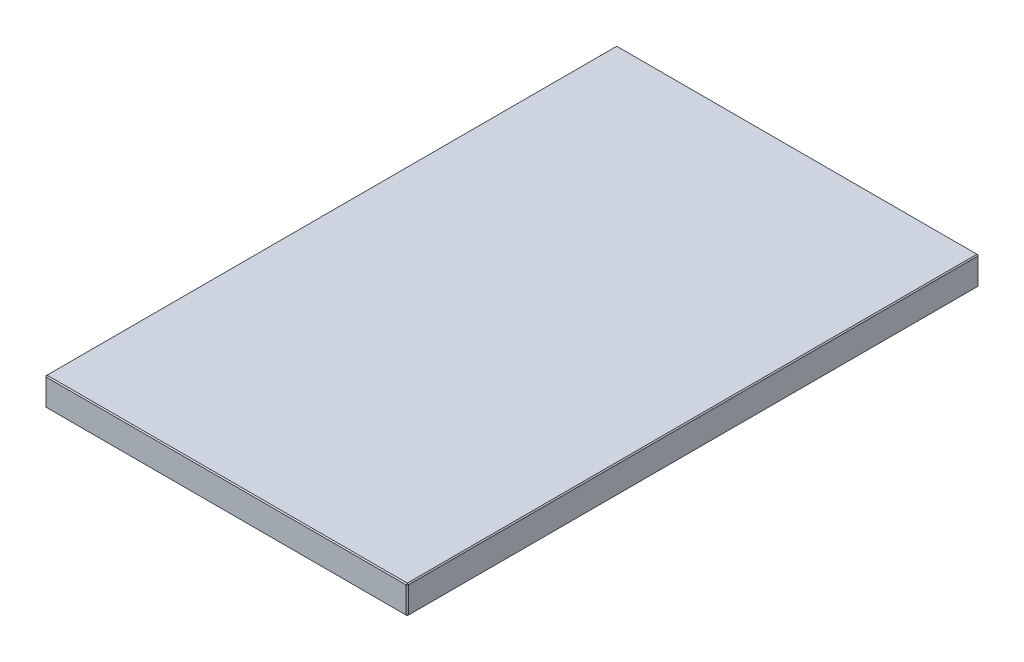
ISO-10303-21;
HEADER;
FILE_DESCRIPTION(('STEP AP214'),'2;1');
FILE_NAME('part.step','',(''),(''),'','','');
FILE_SCHEMA(('AUTOMOTIVE_DESIGN { 1 0 10303 214 1 1 1 1 }'));
ENDSEC;
DATA;
#1=APPLICATION_CONTEXT('core data for automotive mechanical design processes');
#2=APPLICATION_PROTOCOL_DEFINITION('international standard','automotive_design',2000,#1);
#3=PRODUCT_CONTEXT('',#1,'mechanical');
#4=PRODUCT('Part','Part','',(#3));
#5=PRODUCT_RELATED_PRODUCT_CATEGORY('part','',(#4));
#6=PRODUCT_DEFINITION_FORMATION('','',#4);
#7=PRODUCT_DEFINITION_CONTEXT('part definition',#1,'design');
#8=PRODUCT_DEFINITION('design','',#6,#7);
#9=PRODUCT_DEFINITION_SHAPE('','',#8);
#10=(LENGTH_UNIT() NAMED_UNIT(*) SI_UNIT(.MILLI.,.METRE.));
#11=(NAMED_UNIT(*) PLANE_ANGLE_UNIT() SI_UNIT($,.RADIAN.));
#12=(NAMED_UNIT(*) SI_UNIT($,.STERADIAN.) SOLID_ANGLE_UNIT());
#13=UNCERTAINTY_MEASURE_WITH_UNIT(LENGTH_MEASURE(1.E-05),#10,'distance_accuracy_value','');
#14=(GEOMETRIC_REPRESENTATION_CONTEXT(3) GLOBAL_UNCERTAINTY_ASSIGNED_CONTEXT((#13)) GLOBAL_UNIT_ASSIGNED_CONTEXT((#10,
#11,#12)) REPRESENTATION_CONTEXT('',''));
#15=CARTESIAN_POINT('',(0.,0.,0.));
#16=DIRECTION('',(0.,0.,1.));
#17=DIRECTION('',(1.,0.,0.));
#18=AXIS2_PLACEMENT_3D('',#15,#16,#17);
#19=CARTESIAN_POINT('',(-173.,27.,273.));
#20=DIRECTION('',(1.,0.,0.));
#21=DIRECTION('',(0.,0.,-1.));
#22=AXIS2_PLACEMENT_3D('',#19,#20,#21);
#23=PLANE('',#22);
#24=DIRECTION('',(0.,-1.,0.));
#25=VECTOR('',#24,1.);
#26=CARTESIAN_POINT('',(-173.,27.,-272.));
#27=LINE('',#26,#25);
#28=CARTESIAN_POINT('',(-173.,26.,-272.));
#29=VERTEX_POINT('',#28);
#30=CARTESIAN_POINT('',(-173.,0.999999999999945,-272.));
#31=VERTEX_POINT('',#30);
#32=EDGE_CURVE('E114',#29,#31,#27,.T.);
#33=ORIENTED_EDGE('',*,*,#32,.T.);
#34=DIRECTION('',(0.,0.,1.));
#35=VECTOR('',#34,1.);
#36=CARTESIAN_POINT('',(-173.,0.999999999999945,273.));
#37=LINE('',#36,#35);
#38=CARTESIAN_POINT('',(-173.,0.999999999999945,272.));
#39=VERTEX_POINT('',#38);
#40=EDGE_CURVE('E110',#31,#39,#37,.T.);
#41=ORIENTED_EDGE('',*,*,#40,.T.);
#42=DIRECTION('',(0.,1.,0.));
#43=VECTOR('',#42,1.);
#44=CARTESIAN_POINT('',(-173.,27.,272.));
#45=LINE('',#44,#43);
#46=CARTESIAN_POINT('',(-173.,26.,272.));
#47=VERTEX_POINT('',#46);
#48=EDGE_CURVE('E103',#39,#47,#45,.T.);
#49=ORIENTED_EDGE('',*,*,#48,.T.);
#50=DIRECTION('',(0.,0.,-1.));
#51=VECTOR('',#50,1.);
#52=CARTESIAN_POINT('',(-173.,26.,-273.));
#53=LINE('',#52,#51);
#54=EDGE_CURVE('E107',#47,#29,#53,.T.);
#55=ORIENTED_EDGE('',*,*,#54,.T.);
#56=EDGE_LOOP('',(#33,#41,#49,#55));
#57=FACE_BOUND('',#56,.T.);
#58=ADVANCED_FACE('F15',(#57),#23,.F.);
#59=CARTESIAN_POINT('',(173.,27.,273.));
#60=DIRECTION('',(0.,0.,-1.));
#61=DIRECTION('',(-1.,0.,0.));
#62=AXIS2_PLACEMENT_3D('',#59,#60,#61);
#63=PLANE('',#62);
#64=DIRECTION('',(-1.,0.,0.));
#65=VECTOR('',#64,1.);
#66=CARTESIAN_POINT('',(-173.,26.,273.));
#67=LINE('',#66,#65);
#68=CARTESIAN_POINT('',(172.,26.,273.));
#69=VERTEX_POINT('',#68);
#70=CARTESIAN_POINT('',(-172.,26.,273.));
#71=VERTEX_POINT('',#70);
#72=EDGE_CURVE('E164',#69,#71,#67,.T.);
#73=ORIENTED_EDGE('',*,*,#72,.T.);
#74=DIRECTION('',(0.,-1.,0.));
#75=VECTOR('',#74,1.);
#76=CARTESIAN_POINT('',(-172.,27.,273.));
#77=LINE('',#76,#75);
#78=CARTESIAN_POINT('',(-172.,0.999999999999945,273.));
#79=VERTEX_POINT('',#78);
#80=EDGE_CURVE('E122',#71,#79,#77,.T.);
#81=ORIENTED_EDGE('',*,*,#80,.T.);
#82=DIRECTION('',(1.,0.,0.));
#83=VECTOR('',#82,1.);
#84=CARTESIAN_POINT('',(173.,0.999999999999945,273.));
#85=LINE('',#84,#83);
#86=CARTESIAN_POINT('',(172.,0.999999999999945,273.));
#87=VERTEX_POINT('',#86);
#88=EDGE_CURVE('E168',#79,#87,#85,.T.);
#89=ORIENTED_EDGE('',*,*,#88,.T.);
#90=DIRECTION('',(0.,1.,0.));
#91=VECTOR('',#90,1.);
#92=CARTESIAN_POINT('',(172.,27.,273.));
#93=LINE('',#92,#91);
#94=EDGE_CURVE('E166',#87,#69,#93,.T.);
#95=ORIENTED_EDGE('',*,*,#94,.T.);
#96=EDGE_LOOP('',(#73,#81,#89,#95));
#97=FACE_BOUND('',#96,.T.);
#98=ADVANCED_FACE('F275',(#97),#63,.F.);
#99=CARTESIAN_POINT('',(173.,27.,273.));
#100=DIRECTION('',(-1.,0.,0.));
#101=DIRECTION('',(0.,0.,1.));
#102=AXIS2_PLACEMENT_3D('',#99,#100,#101);
#103=PLANE('',#102);
#104=DIRECTION('',(0.,0.,-1.));
#105=VECTOR('',#104,1.);
#106=CARTESIAN_POINT('',(173.,0.999999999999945,273.));
#107=LINE('',#106,#105);
#108=CARTESIAN_POINT('',(173.,0.999999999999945,272.));
#109=VERTEX_POINT('',#108);
#110=CARTESIAN_POINT('',(173.,0.999999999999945,-272.));
#111=VERTEX_POINT('',#110);
#112=EDGE_CURVE('E159',#109,#111,#107,.T.);
#113=ORIENTED_EDGE('',*,*,#112,.T.);
#114=DIRECTION('',(0.,1.,0.));
#115=VECTOR('',#114,1.);
#116=CARTESIAN_POINT('',(173.,27.,-272.));
#117=LINE('',#116,#115);
#118=CARTESIAN_POINT('',(173.,26.,-272.));
#119=VERTEX_POINT('',#118);
#120=EDGE_CURVE('E161',#111,#119,#117,.T.);
#121=ORIENTED_EDGE('',*,*,#120,.T.);
#122=DIRECTION('',(0.,0.,1.));
#123=VECTOR('',#122,1.);
#124=CARTESIAN_POINT('',(173.,26.,273.));
#125=LINE('',#124,#123);
#126=CARTESIAN_POINT('',(173.,26.,272.));
#127=VERTEX_POINT('',#126);
#128=EDGE_CURVE('E155',#119,#127,#125,.T.);
#129=ORIENTED_EDGE('',*,*,#128,.T.);
#130=DIRECTION('',(0.,-1.,0.));
#131=VECTOR('',#130,1.);
#132=CARTESIAN_POINT('',(173.,27.,272.));
#133=LINE('',#132,#131);
#134=EDGE_CURVE('E157',#127,#109,#133,.T.);
#135=ORIENTED_EDGE('',*,*,#134,.T.);
#136=EDGE_LOOP('',(#113,#121,#129,#135));
#137=FACE_BOUND('',#136,.T.);
#138=ADVANCED_FACE('F254',(#137),#103,.F.);
#139=CARTESIAN_POINT('',(173.,27.,-273.));
#140=DIRECTION('',(0.,0.,1.));
#141=DIRECTION('',(1.,0.,0.));
#142=AXIS2_PLACEMENT_3D('',#139,#140,#141);
#143=PLANE('',#142);
#144=DIRECTION('',(0.,-1.,0.));
#145=VECTOR('',#144,1.);
#146=CARTESIAN_POINT('',(172.,27.,-273.));
#147=LINE('',#146,#145);
#148=CARTESIAN_POINT('',(172.,26.,-273.));
#149=VERTEX_POINT('',#148);
#150=CARTESIAN_POINT('',(172.,0.999999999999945,-273.));
#151=VERTEX_POINT('',#150);
#152=EDGE_CURVE('E148',#149,#151,#147,.T.);
#153=ORIENTED_EDGE('',*,*,#152,.T.);
#154=DIRECTION('',(-1.,0.,0.));
#155=VECTOR('',#154,1.);
#156=CARTESIAN_POINT('',(173.,0.999999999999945,-273.));
#157=LINE('',#156,#155);
#158=CARTESIAN_POINT('',(-172.,0.999999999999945,-273.));
#159=VERTEX_POINT('',#158);
#160=EDGE_CURVE('E153',#151,#159,#157,.T.);
#161=ORIENTED_EDGE('',*,*,#160,.T.);
#162=DIRECTION('',(0.,1.,0.));
#163=VECTOR('',#162,1.);
#164=CARTESIAN_POINT('',(-172.,27.,-273.));
#165=LINE('',#164,#163);
#166=CARTESIAN_POINT('',(-172.,26.,-273.));
#167=VERTEX_POINT('',#166);
#168=EDGE_CURVE('E150',#159,#167,#165,.T.);
#169=ORIENTED_EDGE('',*,*,#168,.T.);
#170=DIRECTION('',(1.,0.,0.));
#171=VECTOR('',#170,1.);
#172=CARTESIAN_POINT('',(173.,26.,-273.));
#173=LINE('',#172,#171);
#174=EDGE_CURVE('E146',#167,#149,#173,.T.);
#175=ORIENTED_EDGE('',*,*,#174,.T.);
#176=EDGE_LOOP('',(#153,#161,#169,#175));
#177=FACE_BOUND('',#176,.T.);
#178=ADVANCED_FACE('F284',(#177),#143,.F.);
#179=CARTESIAN_POINT('',(0.,27.,0.));
#180=DIRECTION('',(0.,1.,0.));
#181=DIRECTION('',(0.,0.,1.));
#182=AXIS2_PLACEMENT_3D('',#179,#180,#181);
#183=PLANE('',#182);
#184=DIRECTION('',(0.,0.,-1.));
#185=VECTOR('',#184,1.);
#186=CARTESIAN_POINT('',(172.,27.,-273.));
#187=LINE('',#186,#185);
#188=CARTESIAN_POINT('',(172.,27.,272.));
#189=VERTEX_POINT('',#188);
#190=CARTESIAN_POINT('',(172.,27.,-272.));
#191=VERTEX_POINT('',#190);
#192=EDGE_CURVE('E24',#189,#191,#187,.T.);
#193=ORIENTED_EDGE('',*,*,#192,.T.);
#194=DIRECTION('',(-1.,0.,0.));
#195=VECTOR('',#194,1.);
#196=CARTESIAN_POINT('',(-173.,27.,-272.));
#197=LINE('',#196,#195);
#198=CARTESIAN_POINT('',(-172.,27.,-272.));
#199=VERTEX_POINT('',#198);
#200=EDGE_CURVE('E9',#191,#199,#197,.T.);
#201=ORIENTED_EDGE('',*,*,#200,.T.);
#202=DIRECTION('',(0.,0.,1.));
#203=VECTOR('',#202,1.);
#204=CARTESIAN_POINT('',(-172.,27.,273.));
#205=LINE('',#204,#203);
#206=CARTESIAN_POINT('',(-172.,27.,272.));
#207=VERTEX_POINT('',#206);
#208=EDGE_CURVE('E180',#199,#207,#205,.T.);
#209=ORIENTED_EDGE('',*,*,#208,.T.);
#210=DIRECTION('',(1.,0.,0.));
#211=VECTOR('',#210,1.);
#212=CARTESIAN_POINT('',(173.,27.,272.));
#213=LINE('',#212,#211);
#214=EDGE_CURVE('E35',#207,#189,#213,.T.);
#215=ORIENTED_EDGE('',*,*,#214,.T.);
#216=EDGE_LOOP('',(#193,#201,#209,#215));
#217=FACE_BOUND('',#216,.T.);
#218=ADVANCED_FACE('F350',(#217),#183,.T.);
#219=CARTESIAN_POINT('',(0.,0.,0.));
#220=DIRECTION('',(0.,1.,0.));
#221=DIRECTION('',(0.,0.,1.));
#222=AXIS2_PLACEMENT_3D('',#219,#220,#221);
#223=PLANE('',#222);
#224=DIRECTION('',(0.,0.,1.));
#225=VECTOR('',#224,1.);
#226=CARTESIAN_POINT('',(172.,0.,0.));
#227=LINE('',#226,#225);
#228=CARTESIAN_POINT('',(172.,0.,-272.));
#229=VERTEX_POINT('',#228);
#230=CARTESIAN_POINT('',(172.,0.,272.));
#231=VERTEX_POINT('',#230);
#232=EDGE_CURVE('E171',#229,#231,#227,.T.);
#233=ORIENTED_EDGE('',*,*,#232,.T.);
#234=DIRECTION('',(-1.,0.,0.));
#235=VECTOR('',#234,1.);
#236=CARTESIAN_POINT('',(0.,0.,272.));
#237=LINE('',#236,#235);
#238=CARTESIAN_POINT('',(-172.,0.,272.));
#239=VERTEX_POINT('',#238);
#240=EDGE_CURVE('E177',#231,#239,#237,.T.);
#241=ORIENTED_EDGE('',*,*,#240,.T.);
#242=DIRECTION('',(0.,0.,-1.));
#243=VECTOR('',#242,1.);
#244=CARTESIAN_POINT('',(-172.,0.,0.));
#245=LINE('',#244,#243);
#246=CARTESIAN_POINT('',(-172.,0.,-272.));
#247=VERTEX_POINT('',#246);
#248=EDGE_CURVE('E175',#239,#247,#245,.T.);
#249=ORIENTED_EDGE('',*,*,#248,.T.);
#250=DIRECTION('',(1.,0.,0.));
#251=VECTOR('',#250,1.);
#252=CARTESIAN_POINT('',(0.,0.,-272.));
#253=LINE('',#252,#251);
#254=EDGE_CURVE('E173',#247,#229,#253,.T.);
#255=ORIENTED_EDGE('',*,*,#254,.T.);
#256=EDGE_LOOP('',(#233,#241,#249,#255));
#257=FACE_BOUND('',#256,.T.);
#258=ADVANCED_FACE('F246',(#257),#223,.F.);
#259=CARTESIAN_POINT('',(173.,27.,272.));
#260=DIRECTION('',(-0.707106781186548,0.,-0.707106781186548));
#261=DIRECTION('',(0.,-1.,0.));
#262=AXIS2_PLACEMENT_3D('',#259,#260,#261);
#263=PLANE('',#262);
#264=DIRECTION('',(-0.707106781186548,0.,0.707106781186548));
#265=VECTOR('',#264,1.);
#266=CARTESIAN_POINT('',(172.,26.,273.));
#267=LINE('',#266,#265);
#268=EDGE_CURVE('E19',#69,#127,#267,.F.);
#269=ORIENTED_EDGE('',*,*,#268,.F.);
#270=ORIENTED_EDGE('',*,*,#94,.F.);
#271=DIRECTION('',(0.707106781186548,0.,-0.707106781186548));
#272=VECTOR('',#271,1.);
#273=CARTESIAN_POINT('',(172.,0.999999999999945,273.));
#274=LINE('',#273,#272);
#275=EDGE_CURVE('E142',#109,#87,#274,.F.);
#276=ORIENTED_EDGE('',*,*,#275,.F.);
#277=ORIENTED_EDGE('',*,*,#134,.F.);
#278=EDGE_LOOP('',(#269,#270,#276,#277));
#279=FACE_BOUND('',#278,.T.);
#280=ADVANCED_FACE('F17',(#279),#263,.F.);
#281=CARTESIAN_POINT('',(172.,26.,273.));
#282=DIRECTION('',(0.577350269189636,0.577350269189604,0.577350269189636));
#283=DIRECTION('',(0.707106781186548,0.,-0.707106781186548));
#284=AXIS2_PLACEMENT_3D('',#281,#282,#283);
#285=PLANE('',#284);
#286=DIRECTION('',(0.,-0.707106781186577,0.707106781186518));
#287=VECTOR('',#286,1.);
#288=CARTESIAN_POINT('',(172.,26.,273.));
#289=LINE('',#288,#287);
#290=EDGE_CURVE('E226',#69,#189,#289,.F.);
#291=ORIENTED_EDGE('',*,*,#290,.F.);
#292=ORIENTED_EDGE('',*,*,#268,.T.);
#293=DIRECTION('',(-0.707106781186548,0.707106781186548,0.));
#294=VECTOR('',#293,1.);
#295=CARTESIAN_POINT('',(172.5,26.5,272.));
#296=LINE('',#295,#294);
#297=EDGE_CURVE('E228',#189,#127,#296,.F.);
#298=ORIENTED_EDGE('',*,*,#297,.F.);
#299=EDGE_LOOP('',(#291,#292,#298));
#300=FACE_BOUND('',#299,.T.);
#301=ADVANCED_FACE('F270',(#300),#285,.T.);
#302=CARTESIAN_POINT('',(172.,0.999999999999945,273.));
#303=DIRECTION('',(0.577350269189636,-0.577350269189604,0.577350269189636));
#304=DIRECTION('',(0.707106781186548,0.,-0.707106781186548));
#305=AXIS2_PLACEMENT_3D('',#302,#303,#304);
#306=PLANE('',#305);
#307=DIRECTION('',(-0.707106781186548,-0.707106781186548,0.));
#308=VECTOR('',#307,1.);
#309=CARTESIAN_POINT('',(172.5,0.499999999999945,272.));
#310=LINE('',#309,#308);
#311=EDGE_CURVE('E220',#109,#231,#310,.T.);
#312=ORIENTED_EDGE('',*,*,#311,.F.);
#313=ORIENTED_EDGE('',*,*,#275,.T.);
#314=DIRECTION('',(0.,0.707106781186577,0.707106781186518));
#315=VECTOR('',#314,1.);
#316=CARTESIAN_POINT('',(172.,0.999999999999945,273.));
#317=LINE('',#316,#315);
#318=EDGE_CURVE('E223',#231,#87,#317,.T.);
#319=ORIENTED_EDGE('',*,*,#318,.F.);
#320=EDGE_LOOP('',(#312,#313,#319));
#321=FACE_BOUND('',#320,.T.);
#322=ADVANCED_FACE('F235',(#321),#306,.T.);
#323=CARTESIAN_POINT('',(172.,27.,0.));
#324=DIRECTION('',(0.707106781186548,0.707106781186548,0.));
#325=DIRECTION('',(0.,0.,1.));
#326=AXIS2_PLACEMENT_3D('',#323,#324,#325);
#327=PLANE('',#326);
#328=ORIENTED_EDGE('',*,*,#297,.T.);
#329=ORIENTED_EDGE('',*,*,#128,.F.);
#330=DIRECTION('',(0.707106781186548,-0.707106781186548,0.));
#331=VECTOR('',#330,1.);
#332=CARTESIAN_POINT('',(173.,26.,-272.));
#333=LINE('',#332,#331);
#334=EDGE_CURVE('E215',#191,#119,#333,.T.);
#335=ORIENTED_EDGE('',*,*,#334,.F.);
#336=ORIENTED_EDGE('',*,*,#192,.F.);
#337=EDGE_LOOP('',(#328,#329,#335,#336));
#338=FACE_BOUND('',#337,.T.);
#339=ADVANCED_FACE('F265',(#338),#327,.T.);
#340=CARTESIAN_POINT('',(0.,27.,272.));
#341=DIRECTION('',(0.,0.707106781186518,0.707106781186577));
#342=DIRECTION('',(-1.,0.,0.));
#343=AXIS2_PLACEMENT_3D('',#340,#341,#342);
#344=PLANE('',#343);
#345=ORIENTED_EDGE('',*,*,#290,.T.);
#346=ORIENTED_EDGE('',*,*,#214,.F.);
#347=DIRECTION('',(0.,0.707106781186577,-0.707106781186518));
#348=VECTOR('',#347,1.);
#349=CARTESIAN_POINT('',(-172.,26.5,272.5));
#350=LINE('',#349,#348);
#351=EDGE_CURVE('E126',#71,#207,#350,.T.);
#352=ORIENTED_EDGE('',*,*,#351,.F.);
#353=ORIENTED_EDGE('',*,*,#72,.F.);
#354=EDGE_LOOP('',(#345,#346,#352,#353));
#355=FACE_BOUND('',#354,.T.);
#356=ADVANCED_FACE('F273',(#355),#344,.T.);
#357=CARTESIAN_POINT('',(-172.,27.,273.));
#358=DIRECTION('',(0.707106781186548,0.,-0.707106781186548));
#359=DIRECTION('',(0.,-1.,0.));
#360=AXIS2_PLACEMENT_3D('',#357,#358,#359);
#361=PLANE('',#360);
#362=DIRECTION('',(0.707106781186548,0.,0.707106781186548));
#363=VECTOR('',#362,1.);
#364=CARTESIAN_POINT('',(-172.,0.999999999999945,273.));
#365=LINE('',#364,#363);
#366=EDGE_CURVE('E127',#79,#39,#365,.F.);
#367=ORIENTED_EDGE('',*,*,#366,.F.);
#368=ORIENTED_EDGE('',*,*,#80,.F.);
#369=DIRECTION('',(-0.707106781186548,0.,-0.707106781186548));
#370=VECTOR('',#369,1.);
#371=CARTESIAN_POINT('',(-173.,26.,272.));
#372=LINE('',#371,#370);
#373=EDGE_CURVE('E118',#47,#71,#372,.F.);
#374=ORIENTED_EDGE('',*,*,#373,.F.);
#375=ORIENTED_EDGE('',*,*,#48,.F.);
#376=EDGE_LOOP('',(#367,#368,#374,#375));
#377=FACE_BOUND('',#376,.T.);
#378=ADVANCED_FACE('F120',(#377),#361,.F.);
#379=CARTESIAN_POINT('',(173.,0.999999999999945,273.));
#380=DIRECTION('',(0.,0.707106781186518,-0.707106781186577));
#381=DIRECTION('',(1.,0.,0.));
#382=AXIS2_PLACEMENT_3D('',#379,#380,#381);
#383=PLANE('',#382);
#384=ORIENTED_EDGE('',*,*,#318,.T.);
#385=ORIENTED_EDGE('',*,*,#88,.F.);
#386=DIRECTION('',(0.,-0.707106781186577,-0.707106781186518));
#387=VECTOR('',#386,1.);
#388=CARTESIAN_POINT('',(-172.,0.999999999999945,273.));
#389=LINE('',#388,#387);
#390=EDGE_CURVE('E211',#239,#79,#389,.F.);
#391=ORIENTED_EDGE('',*,*,#390,.F.);
#392=ORIENTED_EDGE('',*,*,#240,.F.);
#393=EDGE_LOOP('',(#384,#385,#391,#392));
#394=FACE_BOUND('',#393,.T.);
#395=ADVANCED_FACE('F243',(#394),#383,.F.);
#396=CARTESIAN_POINT('',(173.,0.999999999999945,273.));
#397=DIRECTION('',(-0.707106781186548,0.707106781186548,0.));
#398=DIRECTION('',(0.,0.,-1.));
#399=AXIS2_PLACEMENT_3D('',#396,#397,#398);
#400=PLANE('',#399);
#401=ORIENTED_EDGE('',*,*,#311,.T.);
#402=ORIENTED_EDGE('',*,*,#232,.F.);
#403=DIRECTION('',(0.707106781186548,0.707106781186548,-1.17923313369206E-13));
#404=VECTOR('',#403,1.);
#405=CARTESIAN_POINT('',(172.5,0.500000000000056,-272.));
#406=LINE('',#405,#404);
#407=EDGE_CURVE('E208',#111,#229,#406,.F.);
#408=ORIENTED_EDGE('',*,*,#407,.F.);
#409=ORIENTED_EDGE('',*,*,#112,.F.);
#410=EDGE_LOOP('',(#401,#402,#408,#409));
#411=FACE_BOUND('',#410,.T.);
#412=ADVANCED_FACE('F251',(#411),#400,.F.);
#413=CARTESIAN_POINT('',(172.,27.,-273.));
#414=DIRECTION('',(-0.707106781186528,0.,0.707106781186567));
#415=DIRECTION('',(0.,-1.,0.));
#416=AXIS2_PLACEMENT_3D('',#413,#414,#415);
#417=PLANE('',#416);
#418=DIRECTION('',(0.707106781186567,0.,0.707106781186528));
#419=VECTOR('',#418,1.);
#420=CARTESIAN_POINT('',(173.,26.,-272.));
#421=LINE('',#420,#419);
#422=EDGE_CURVE('E217',#119,#149,#421,.F.);
#423=ORIENTED_EDGE('',*,*,#422,.F.);
#424=ORIENTED_EDGE('',*,*,#120,.F.);
#425=DIRECTION('',(-0.707106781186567,0.,-0.707106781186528));
#426=VECTOR('',#425,1.);
#427=CARTESIAN_POINT('',(172.,0.999999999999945,-273.));
#428=LINE('',#427,#426);
#429=EDGE_CURVE('E205',#151,#111,#428,.F.);
#430=ORIENTED_EDGE('',*,*,#429,.F.);
#431=ORIENTED_EDGE('',*,*,#152,.F.);
#432=EDGE_LOOP('',(#423,#424,#430,#431));
#433=FACE_BOUND('',#432,.T.);
#434=ADVANCED_FACE('F258',(#433),#417,.F.);
#435=CARTESIAN_POINT('',(173.,26.,-272.));
#436=DIRECTION('',(0.577350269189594,0.577350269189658,-0.577350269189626));
#437=DIRECTION('',(0.,0.707106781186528,0.707106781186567));
#438=AXIS2_PLACEMENT_3D('',#435,#436,#437);
#439=PLANE('',#438);
#440=ORIENTED_EDGE('',*,*,#334,.T.);
#441=ORIENTED_EDGE('',*,*,#422,.T.);
#442=DIRECTION('',(0.,0.707106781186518,0.707106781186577));
#443=VECTOR('',#442,1.);
#444=CARTESIAN_POINT('',(172.,26.5,-272.5));
#445=LINE('',#444,#443);
#446=EDGE_CURVE('E134',#191,#149,#445,.F.);
#447=ORIENTED_EDGE('',*,*,#446,.F.);
#448=EDGE_LOOP('',(#440,#441,#447));
#449=FACE_BOUND('',#448,.T.);
#450=ADVANCED_FACE('F325',(#449),#439,.T.);
#451=CARTESIAN_POINT('',(-173.,26.,272.));
#452=DIRECTION('',(-0.577350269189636,0.577350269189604,0.577350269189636));
#453=DIRECTION('',(0.707106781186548,0.,0.707106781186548));
#454=AXIS2_PLACEMENT_3D('',#451,#452,#453);
#455=PLANE('',#454);
#456=ORIENTED_EDGE('',*,*,#373,.T.);
#457=ORIENTED_EDGE('',*,*,#351,.T.);
#458=DIRECTION('',(-0.707106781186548,-0.707106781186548,0.));
#459=VECTOR('',#458,1.);
#460=CARTESIAN_POINT('',(-173.,26.,272.));
#461=LINE('',#460,#459);
#462=EDGE_CURVE('E130',#47,#207,#461,.F.);
#463=ORIENTED_EDGE('',*,*,#462,.F.);
#464=EDGE_LOOP('',(#456,#457,#463));
#465=FACE_BOUND('',#464,.T.);
#466=ADVANCED_FACE('F131',(#465),#455,.T.);
#467=CARTESIAN_POINT('',(-172.,0.999999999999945,273.));
#468=DIRECTION('',(-0.577350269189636,-0.577350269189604,0.577350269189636));
#469=DIRECTION('',(0.707106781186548,0.,0.707106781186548));
#470=AXIS2_PLACEMENT_3D('',#467,#468,#469);
#471=PLANE('',#470);
#472=ORIENTED_EDGE('',*,*,#390,.T.);
#473=ORIENTED_EDGE('',*,*,#366,.T.);
#474=DIRECTION('',(-0.707106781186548,0.707106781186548,0.));
#475=VECTOR('',#474,1.);
#476=CARTESIAN_POINT('',(-172.5,0.499999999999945,272.));
#477=LINE('',#476,#475);
#478=EDGE_CURVE('E135',#239,#39,#477,.T.);
#479=ORIENTED_EDGE('',*,*,#478,.F.);
#480=EDGE_LOOP('',(#472,#473,#479));
#481=FACE_BOUND('',#480,.T.);
#482=ADVANCED_FACE('F318',(#481),#471,.T.);
#483=CARTESIAN_POINT('',(172.,0.999999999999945,-273.));
#484=DIRECTION('',(0.577350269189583,-0.577350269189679,-0.577350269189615));
#485=DIRECTION('',(0.,0.707106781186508,-0.707106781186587));
#486=AXIS2_PLACEMENT_3D('',#483,#484,#485);
#487=PLANE('',#486);
#488=ORIENTED_EDGE('',*,*,#429,.T.);
#489=ORIENTED_EDGE('',*,*,#407,.T.);
#490=DIRECTION('',(0.,-0.707106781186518,0.707106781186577));
#491=VECTOR('',#490,1.);
#492=CARTESIAN_POINT('',(172.,0.999999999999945,-273.));
#493=LINE('',#492,#491);
#494=EDGE_CURVE('E198',#151,#229,#493,.T.);
#495=ORIENTED_EDGE('',*,*,#494,.F.);
#496=EDGE_LOOP('',(#488,#489,#495));
#497=FACE_BOUND('',#496,.T.);
#498=ADVANCED_FACE('F314',(#497),#487,.T.);
#499=CARTESIAN_POINT('',(0.,27.,-272.));
#500=DIRECTION('',(0.,0.707106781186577,-0.707106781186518));
#501=DIRECTION('',(1.,0.,0.));
#502=AXIS2_PLACEMENT_3D('',#499,#500,#501);
#503=PLANE('',#502);
#504=ORIENTED_EDGE('',*,*,#446,.T.);
#505=ORIENTED_EDGE('',*,*,#174,.F.);
#506=DIRECTION('',(0.,-0.707106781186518,-0.707106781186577));
#507=VECTOR('',#506,1.);
#508=CARTESIAN_POINT('',(-172.,26.,-273.));
#509=LINE('',#508,#507);
#510=EDGE_CURVE('E195',#199,#167,#509,.T.);
#511=ORIENTED_EDGE('',*,*,#510,.F.);
#512=ORIENTED_EDGE('',*,*,#200,.F.);
#513=EDGE_LOOP('',(#504,#505,#511,#512));
#514=FACE_BOUND('',#513,.T.);
#515=ADVANCED_FACE('F311',(#514),#503,.T.);
#516=CARTESIAN_POINT('',(-172.,27.,0.));
#517=DIRECTION('',(-0.707106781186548,0.707106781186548,0.));
#518=DIRECTION('',(0.,0.,-1.));
#519=AXIS2_PLACEMENT_3D('',#516,#517,#518);
#520=PLANE('',#519);
#521=ORIENTED_EDGE('',*,*,#462,.T.);
#522=ORIENTED_EDGE('',*,*,#208,.F.);
#523=DIRECTION('',(0.707106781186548,0.707106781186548,0.));
#524=VECTOR('',#523,1.);
#525=CARTESIAN_POINT('',(-172.5,26.5,-272.));
#526=LINE('',#525,#524);
#527=EDGE_CURVE('E138',#29,#199,#526,.T.);
#528=ORIENTED_EDGE('',*,*,#527,.F.);
#529=ORIENTED_EDGE('',*,*,#54,.F.);
#530=EDGE_LOOP('',(#521,#522,#528,#529));
#531=FACE_BOUND('',#530,.T.);
#532=ADVANCED_FACE('F137',(#531),#520,.T.);
#533=CARTESIAN_POINT('',(-173.,0.999999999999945,273.));
#534=DIRECTION('',(0.707106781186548,0.707106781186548,0.));
#535=DIRECTION('',(0.,0.,1.));
#536=AXIS2_PLACEMENT_3D('',#533,#534,#535);
#537=PLANE('',#536);
#538=ORIENTED_EDGE('',*,*,#478,.T.);
#539=ORIENTED_EDGE('',*,*,#40,.F.);
#540=DIRECTION('',(0.707106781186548,-0.707106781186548,1.17611407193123E-13));
#541=VECTOR('',#540,1.);
#542=CARTESIAN_POINT('',(-173.,0.999999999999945,-272.));
#543=LINE('',#542,#541);
#544=EDGE_CURVE('E191',#247,#31,#543,.F.);
#545=ORIENTED_EDGE('',*,*,#544,.F.);
#546=ORIENTED_EDGE('',*,*,#248,.F.);
#547=EDGE_LOOP('',(#538,#539,#545,#546));
#548=FACE_BOUND('',#547,.T.);
#549=ADVANCED_FACE('F304',(#548),#537,.F.);
#550=CARTESIAN_POINT('',(173.,0.999999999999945,-273.));
#551=DIRECTION('',(0.,0.707106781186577,0.707106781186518));
#552=DIRECTION('',(-1.,0.,0.));
#553=AXIS2_PLACEMENT_3D('',#550,#551,#552);
#554=PLANE('',#553);
#555=ORIENTED_EDGE('',*,*,#494,.T.);
#556=ORIENTED_EDGE('',*,*,#254,.F.);
#557=DIRECTION('',(0.,0.707106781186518,-0.707106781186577));
#558=VECTOR('',#557,1.);
#559=CARTESIAN_POINT('',(-172.,0.500000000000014,-272.5));
#560=LINE('',#559,#558);
#561=EDGE_CURVE('E188',#159,#247,#560,.F.);
#562=ORIENTED_EDGE('',*,*,#561,.F.);
#563=ORIENTED_EDGE('',*,*,#160,.F.);
#564=EDGE_LOOP('',(#555,#556,#562,#563));
#565=FACE_BOUND('',#564,.T.);
#566=ADVANCED_FACE('F300',(#565),#554,.F.);
#567=CARTESIAN_POINT('',(-172.,26.,-273.));
#568=DIRECTION('',(-0.577350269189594,0.577350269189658,-0.577350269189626));
#569=DIRECTION('',(0.,0.707106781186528,0.707106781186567));
#570=AXIS2_PLACEMENT_3D('',#567,#568,#569);
#571=PLANE('',#570);
#572=ORIENTED_EDGE('',*,*,#527,.T.);
#573=ORIENTED_EDGE('',*,*,#510,.T.);
#574=DIRECTION('',(0.707106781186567,0.,-0.707106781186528));
#575=VECTOR('',#574,1.);
#576=CARTESIAN_POINT('',(-172.,26.,-273.));
#577=LINE('',#576,#575);
#578=EDGE_CURVE('E186',#29,#167,#577,.T.);
#579=ORIENTED_EDGE('',*,*,#578,.F.);
#580=EDGE_LOOP('',(#572,#573,#579));
#581=FACE_BOUND('',#580,.T.);
#582=ADVANCED_FACE('F296',(#581),#571,.T.);
#583=CARTESIAN_POINT('',(-173.,0.999999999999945,-272.));
#584=DIRECTION('',(-0.577350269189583,-0.577350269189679,-0.577350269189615));
#585=DIRECTION('',(0.,0.707106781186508,-0.707106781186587));
#586=AXIS2_PLACEMENT_3D('',#583,#584,#585);
#587=PLANE('',#586);
#588=ORIENTED_EDGE('',*,*,#561,.T.);
#589=ORIENTED_EDGE('',*,*,#544,.T.);
#590=DIRECTION('',(-0.707106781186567,0.,0.707106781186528));
#591=VECTOR('',#590,1.);
#592=CARTESIAN_POINT('',(-173.,0.999999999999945,-272.));
#593=LINE('',#592,#591);
#594=EDGE_CURVE('E184',#159,#31,#593,.T.);
#595=ORIENTED_EDGE('',*,*,#594,.F.);
#596=EDGE_LOOP('',(#588,#589,#595));
#597=FACE_BOUND('',#596,.T.);
#598=ADVANCED_FACE('F292',(#597),#587,.T.);
#599=CARTESIAN_POINT('',(-173.,27.,-272.));
#600=DIRECTION('',(0.707106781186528,0.,0.707106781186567));
#601=DIRECTION('',(0.,-1.,0.));
#602=AXIS2_PLACEMENT_3D('',#599,#600,#601);
#603=PLANE('',#602);
#604=ORIENTED_EDGE('',*,*,#578,.T.);
#605=ORIENTED_EDGE('',*,*,#168,.F.);
#606=ORIENTED_EDGE('',*,*,#594,.T.);
#607=ORIENTED_EDGE('',*,*,#32,.F.);
#608=EDGE_LOOP('',(#604,#605,#606,#607));
#609=FACE_BOUND('',#608,.T.);
#610=ADVANCED_FACE('F289',(#609),#603,.F.);
#611=CLOSED_SHELL('',(#58,#98,#138,#178,#218,#258,#280,#301,#322,#339,#356,#378,#395,#412,#434,
#450,#466,#482,#498,#515,#532,#549,#566,#582,#598,#610));
#612=MANIFOLD_SOLID_BREP('B1',#611);
#613=ADVANCED_BREP_SHAPE_REPRESENTATION('',(#18,#612),#14);
#614=SHAPE_DEFINITION_REPRESENTATION(#9,#613);
ENDSEC;
END-ISO-10303-21;
